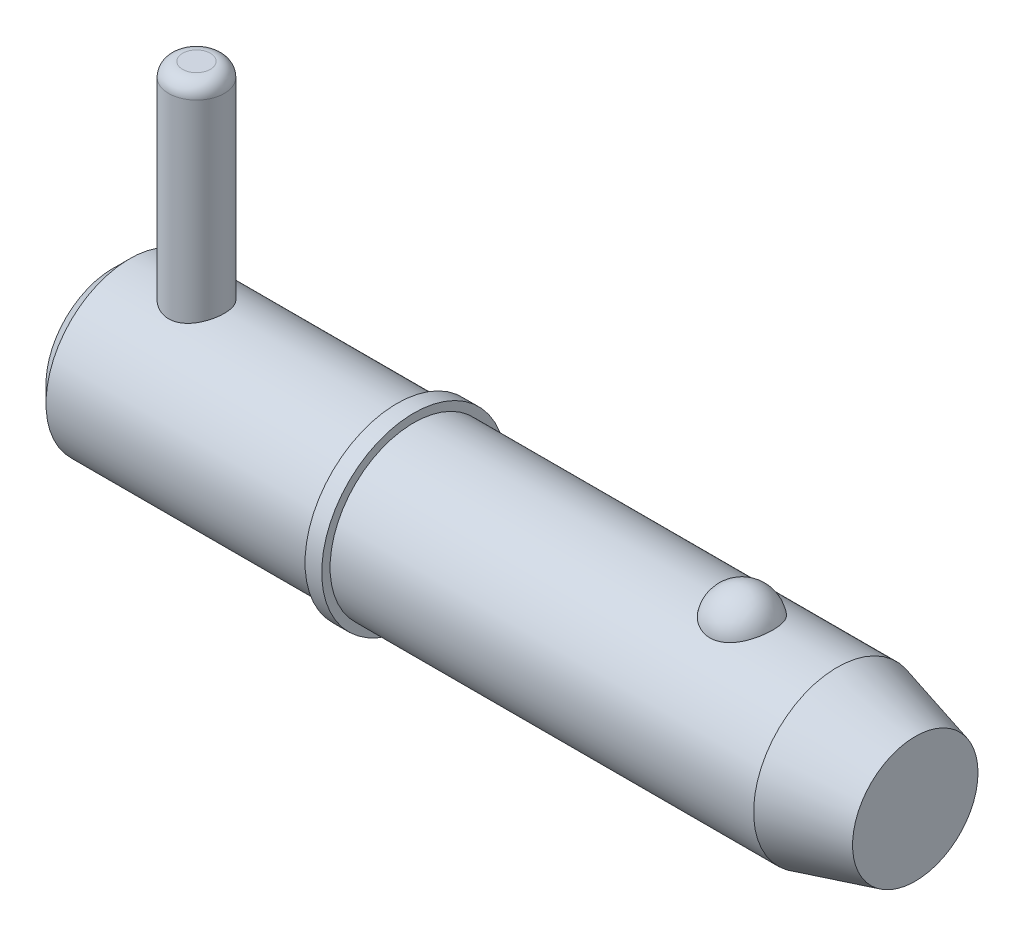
ISO-10303-21;
HEADER;
FILE_DESCRIPTION(('STEP AP214'),'2;1');
FILE_NAME('part.step','',(''),(''),'','','');
FILE_SCHEMA(('AUTOMOTIVE_DESIGN { 1 0 10303 214 1 1 1 1 }'));
ENDSEC;
DATA;
#1=APPLICATION_CONTEXT('core data for automotive mechanical design processes');
#2=APPLICATION_PROTOCOL_DEFINITION('international standard','automotive_design',2000,#1);
#3=PRODUCT_CONTEXT('',#1,'mechanical');
#4=PRODUCT('Part','Part','',(#3));
#5=PRODUCT_RELATED_PRODUCT_CATEGORY('part','',(#4));
#6=PRODUCT_DEFINITION_FORMATION('','',#4);
#7=PRODUCT_DEFINITION_CONTEXT('part definition',#1,'design');
#8=PRODUCT_DEFINITION('design','',#6,#7);
#9=PRODUCT_DEFINITION_SHAPE('','',#8);
#10=(LENGTH_UNIT() NAMED_UNIT(*) SI_UNIT(.MILLI.,.METRE.));
#11=(NAMED_UNIT(*) PLANE_ANGLE_UNIT() SI_UNIT($,.RADIAN.));
#12=(NAMED_UNIT(*) SI_UNIT($,.STERADIAN.) SOLID_ANGLE_UNIT());
#13=UNCERTAINTY_MEASURE_WITH_UNIT(LENGTH_MEASURE(1.E-05),#10,'distance_accuracy_value','');
#14=(GEOMETRIC_REPRESENTATION_CONTEXT(3) GLOBAL_UNCERTAINTY_ASSIGNED_CONTEXT((#13)) GLOBAL_UNIT_ASSIGNED_CONTEXT((#10,
#11,#12)) REPRESENTATION_CONTEXT('',''));
#15=CARTESIAN_POINT('',(0.,0.,0.));
#16=DIRECTION('',(0.,0.,1.));
#17=DIRECTION('',(1.,0.,0.));
#18=AXIS2_PLACEMENT_3D('',#15,#16,#17);
#19=CARTESIAN_POINT('',(7.14,24.605,0.));
#20=DIRECTION('',(0.,-1.,0.));
#21=DIRECTION('',(0.,0.,-1.));
#22=AXIS2_PLACEMENT_3D('',#19,#20,#21);
#23=CYLINDRICAL_SURFACE('',#22,2.38);
#24=CARTESIAN_POINT('',(7.14,-5.955,0.));
#25=DIRECTION('',(0.,1.,0.));
#26=DIRECTION('',(0.,0.,1.));
#27=AXIS2_PLACEMENT_3D('',#24,#25,#26);
#28=CIRCLE('',#27,2.38);
#29=CARTESIAN_POINT('',(7.14,-5.955,2.38));
#30=VERTEX_POINT('',#29);
#31=EDGE_CURVE('P0_E25',#30,#30,#28,.T.);
#32=ORIENTED_EDGE('',*,*,#31,.T.);
#33=EDGE_LOOP('',(#32));
#34=FACE_BOUND('',#33,.T.);
#35=CARTESIAN_POINT('',(7.14,23.415,0.));
#36=DIRECTION('',(0.,1.,0.));
#37=DIRECTION('',(0.,0.,1.));
#38=AXIS2_PLACEMENT_3D('',#35,#36,#37);
#39=CIRCLE('',#38,2.38);
#40=CARTESIAN_POINT('',(7.14,23.415,2.38));
#41=VERTEX_POINT('',#40);
#42=EDGE_CURVE('P0_E29',#41,#41,#39,.F.);
#43=ORIENTED_EDGE('',*,*,#42,.T.);
#44=EDGE_LOOP('',(#43));
#45=FACE_BOUND('',#44,.T.);
#46=ADVANCED_FACE('P0_F14',(#34,#45),#23,.T.);
#47=CARTESIAN_POINT('',(7.14,24.605,0.));
#48=DIRECTION('',(0.,1.,0.));
#49=DIRECTION('',(0.,0.,1.));
#50=AXIS2_PLACEMENT_3D('',#47,#48,#49);
#51=PLANE('',#50);
#52=CARTESIAN_POINT('',(7.14,24.605,0.));
#53=DIRECTION('',(0.,1.,0.));
#54=DIRECTION('',(0.,0.,1.));
#55=AXIS2_PLACEMENT_3D('',#52,#53,#54);
#56=CIRCLE('',#55,1.19);
#57=CARTESIAN_POINT('',(7.14,24.605,1.19));
#58=VERTEX_POINT('',#57);
#59=EDGE_CURVE('P0_E10',#58,#58,#56,.T.);
#60=ORIENTED_EDGE('',*,*,#59,.T.);
#61=EDGE_LOOP('',(#60));
#62=FACE_BOUND('',#61,.T.);
#63=ADVANCED_FACE('P0_F46',(#62),#51,.T.);
#64=CARTESIAN_POINT('',(7.14,-7.145,0.));
#65=DIRECTION('',(0.,1.,0.));
#66=DIRECTION('',(0.,0.,1.));
#67=AXIS2_PLACEMENT_3D('',#64,#65,#66);
#68=PLANE('',#67);
#69=CARTESIAN_POINT('',(7.14,-7.145,0.));
#70=DIRECTION('',(0.,1.,0.));
#71=DIRECTION('',(0.,0.,1.));
#72=AXIS2_PLACEMENT_3D('',#69,#70,#71);
#73=CIRCLE('',#72,1.19);
#74=CARTESIAN_POINT('',(7.14,-7.145,1.19));
#75=VERTEX_POINT('',#74);
#76=EDGE_CURVE('P0_E21',#75,#75,#73,.F.);
#77=ORIENTED_EDGE('',*,*,#76,.T.);
#78=EDGE_LOOP('',(#77));
#79=FACE_BOUND('',#78,.T.);
#80=ADVANCED_FACE('P0_F43',(#79),#68,.F.);
#81=CARTESIAN_POINT('',(7.14,-5.955,0.));
#82=DIRECTION('',(0.,1.,0.));
#83=DIRECTION('',(0.,0.,1.));
#84=AXIS2_PLACEMENT_3D('',#81,#82,#83);
#85=DEGENERATE_TOROIDAL_SURFACE('',#84,1.19,1.19,.T.);
#86=ORIENTED_EDGE('',*,*,#76,.F.);
#87=EDGE_LOOP('',(#86));
#88=FACE_BOUND('',#87,.T.);
#89=ORIENTED_EDGE('',*,*,#31,.F.);
#90=EDGE_LOOP('',(#89));
#91=FACE_BOUND('',#90,.T.);
#92=ADVANCED_FACE('P0_F38',(#88,#91),#85,.T.);
#93=CARTESIAN_POINT('',(7.14,23.415,0.));
#94=DIRECTION('',(0.,1.,0.));
#95=DIRECTION('',(0.,0.,1.));
#96=AXIS2_PLACEMENT_3D('',#93,#94,#95);
#97=DEGENERATE_TOROIDAL_SURFACE('',#96,1.19,1.19,.T.);
#98=ORIENTED_EDGE('',*,*,#42,.F.);
#99=EDGE_LOOP('',(#98));
#100=FACE_BOUND('',#99,.T.);
#101=ORIENTED_EDGE('',*,*,#59,.F.);
#102=EDGE_LOOP('',(#101));
#103=FACE_BOUND('',#102,.T.);
#104=ADVANCED_FACE('P0_F16',(#100,#103),#97,.T.);
#105=CLOSED_SHELL('',(#46,#63,#80,#92,#104));
#106=MANIFOLD_SOLID_BREP('P0_B1',#105);
#107=CARTESIAN_POINT('',(0.,0.,0.));
#108=DIRECTION('',(1.,0.,0.));
#109=DIRECTION('',(0.,0.,-1.));
#110=AXIS2_PLACEMENT_3D('',#107,#108,#109);
#111=CYLINDRICAL_SURFACE('',#110,7.145);
#112=CARTESIAN_POINT('',(61.8836242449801,0.,0.));
#113=DIRECTION('',(1.,0.,0.));
#114=DIRECTION('',(0.,0.,-1.));
#115=AXIS2_PLACEMENT_3D('',#112,#113,#114);
#116=CIRCLE('',#115,7.145);
#117=CARTESIAN_POINT('',(61.8836242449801,0.,-7.145));
#118=VERTEX_POINT('',#117);
#119=EDGE_CURVE('P1_E81',#118,#118,#116,.T.);
#120=ORIENTED_EDGE('',*,*,#119,.F.);
#121=EDGE_LOOP('',(#120));
#122=FACE_BOUND('',#121,.T.);
#123=CARTESIAN_POINT('',(25.7,0.,0.));
#124=DIRECTION('',(1.,0.,0.));
#125=DIRECTION('',(0.,0.,-1.));
#126=AXIS2_PLACEMENT_3D('',#123,#124,#125);
#127=CIRCLE('',#126,7.145);
#128=CARTESIAN_POINT('',(25.7,0.,-7.145));
#129=VERTEX_POINT('',#128);
#130=EDGE_CURVE('P1_E85',#129,#129,#127,.T.);
#131=ORIENTED_EDGE('',*,*,#130,.T.);
#132=EDGE_LOOP('',(#131));
#133=FACE_BOUND('',#132,.T.);
#134=CARTESIAN_POINT('',(53.7395037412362,6.60328629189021,2.72903557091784));
#135=CARTESIAN_POINT('',(53.5983158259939,6.60329644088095,2.7290249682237));
#136=CARTESIAN_POINT('',(53.4568832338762,6.60799490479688,2.71772840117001));
#137=CARTESIAN_POINT('',(53.1779557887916,6.62628236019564,2.6728193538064));
#138=CARTESIAN_POINT('',(53.0404726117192,6.63989534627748,2.63914664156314));
#139=CARTESIAN_POINT('',(52.7738894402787,6.67440775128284,2.55059642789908));
#140=CARTESIAN_POINT('',(52.6447683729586,6.69528793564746,2.49577486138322));
#141=CARTESIAN_POINT('',(52.3978694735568,6.74205585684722,2.36651799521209));
#142=CARTESIAN_POINT('',(52.2800865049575,6.76794130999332,2.29209163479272));
#143=CARTESIAN_POINT('',(52.0551671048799,6.82286177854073,2.12312937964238));
#144=CARTESIAN_POINT('',(51.9484405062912,6.85196655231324,2.02807107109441));
#145=CARTESIAN_POINT('',(51.7519181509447,6.90970232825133,1.82167822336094));
#146=CARTESIAN_POINT('',(51.6621276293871,6.93833318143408,1.71033867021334));
#147=CARTESIAN_POINT('',(51.4976670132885,6.9935167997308,1.46891951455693));
#148=CARTESIAN_POINT('',(51.423844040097,7.01992110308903,1.33822781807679));
#149=CARTESIAN_POINT('',(51.2980884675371,7.06643385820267,1.0656656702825));
#150=CARTESIAN_POINT('',(51.2461573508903,7.08654188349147,0.923794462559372));
#151=CARTESIAN_POINT('',(51.1647323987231,7.11862399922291,0.630993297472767));
#152=CARTESIAN_POINT('',(51.1355167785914,7.13049704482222,0.479974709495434));
#153=CARTESIAN_POINT('',(51.1011742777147,7.14449484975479,0.174782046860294));
#154=CARTESIAN_POINT('',(51.0960466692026,7.14661990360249,0.0206080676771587));
#155=CARTESIAN_POINT('',(51.109938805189,7.14092465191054,-0.285506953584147));
#156=CARTESIAN_POINT('',(51.1288101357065,7.1331654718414,-0.437455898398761));
#157=CARTESIAN_POINT('',(51.1900622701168,7.10859076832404,-0.735778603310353));
#158=CARTESIAN_POINT('',(51.2324435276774,7.0917750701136,-0.882152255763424));
#159=CARTESIAN_POINT('',(51.3399346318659,7.05076716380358,-1.165431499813));
#160=CARTESIAN_POINT('',(51.4050759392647,7.02656475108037,-1.30232366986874));
#161=CARTESIAN_POINT('',(51.5567597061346,6.97329145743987,-1.56265907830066));
#162=CARTESIAN_POINT('',(51.643303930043,6.94422017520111,-1.68610120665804));
#163=CARTESIAN_POINT('',(51.8364654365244,6.88415108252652,-1.91671004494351));
#164=CARTESIAN_POINT('',(51.9431807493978,6.85314438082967,-2.02379244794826));
#165=CARTESIAN_POINT('',(52.1739740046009,6.79282069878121,-2.21787433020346));
#166=CARTESIAN_POINT('',(52.2980505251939,6.76350358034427,-2.30487545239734));
#167=CARTESIAN_POINT('',(52.5576784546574,6.71060580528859,-2.45458647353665));
#168=CARTESIAN_POINT('',(52.6929387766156,6.68691885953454,-2.51776240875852));
#169=CARTESIAN_POINT('',(52.9732778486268,6.64741247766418,-2.62030218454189));
#170=CARTESIAN_POINT('',(53.1183528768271,6.63159007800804,-2.65967499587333));
#171=CARTESIAN_POINT('',(53.4063475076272,6.61038594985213,-2.71193301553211));
#172=CARTESIAN_POINT('',(53.5490080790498,6.60451880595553,-2.72605165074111));
#173=CARTESIAN_POINT('',(53.8348004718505,6.60240611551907,-2.73116688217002));
#174=CARTESIAN_POINT('',(53.9779321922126,6.60615862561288,-2.72216814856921));
#175=CARTESIAN_POINT('',(54.2558486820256,6.6225609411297,-2.68200435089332));
#176=CARTESIAN_POINT('',(54.3907542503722,6.63492533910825,-2.65154998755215));
#177=CARTESIAN_POINT('',(54.65332009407,6.66687445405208,-2.57015684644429));
#178=CARTESIAN_POINT('',(54.7809797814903,6.68645975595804,-2.51921640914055));
#179=CARTESIAN_POINT('',(55.0285777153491,6.73127274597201,-2.39693610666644));
#180=CARTESIAN_POINT('',(55.148287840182,6.7566138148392,-2.32517694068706));
#181=CARTESIAN_POINT('',(55.3741592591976,6.8100600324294,-2.16363812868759));
#182=CARTESIAN_POINT('',(55.480317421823,6.83816581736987,-2.07385432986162));
#183=CARTESIAN_POINT('',(55.6818620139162,6.89580469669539,-1.87357235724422));
#184=CARTESIAN_POINT('',(55.776440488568,6.92533863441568,-1.76226074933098));
#185=CARTESIAN_POINT('',(55.9463329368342,6.98139526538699,-1.52511696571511));
#186=CARTESIAN_POINT('',(56.0216434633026,7.0079174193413,-1.39928219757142));
#187=CARTESIAN_POINT('',(56.153595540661,7.05607625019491,-1.1321597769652));
#188=CARTESIAN_POINT('',(56.2095688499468,7.07753119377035,-0.990508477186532));
#189=CARTESIAN_POINT('',(56.2982965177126,7.11222355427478,-0.699154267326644));
#190=CARTESIAN_POINT('',(56.3310506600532,7.12546089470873,-0.549451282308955));
#191=CARTESIAN_POINT('',(56.3726899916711,7.14237584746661,-0.246120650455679));
#192=CARTESIAN_POINT('',(56.381558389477,7.14604673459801,-0.0924903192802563));
#193=CARTESIAN_POINT('',(56.3751940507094,7.14343510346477,0.214181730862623));
#194=CARTESIAN_POINT('',(56.3599618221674,7.13715279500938,0.367223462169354));
#195=CARTESIAN_POINT('',(56.3058451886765,7.1153294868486,0.667595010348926));
#196=CARTESIAN_POINT('',(56.2670776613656,7.09983424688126,0.814949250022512));
#197=CARTESIAN_POINT('',(56.1667700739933,7.06119140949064,1.10063221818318));
#198=CARTESIAN_POINT('',(56.1052284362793,7.03804328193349,1.238960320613));
#199=CARTESIAN_POINT('',(55.9602071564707,6.98632429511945,1.50352300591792));
#200=CARTESIAN_POINT('',(55.8766067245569,6.95772382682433,1.62968561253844));
#201=CARTESIAN_POINT('',(55.6893804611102,6.89823072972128,1.86554304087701));
#202=CARTESIAN_POINT('',(55.5857557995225,6.86733823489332,1.97523882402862));
#203=CARTESIAN_POINT('',(55.3610769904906,6.80676456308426,2.17482293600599));
#204=CARTESIAN_POINT('',(55.2400673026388,6.7770805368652,2.26476035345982));
#205=CARTESIAN_POINT('',(54.9833408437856,6.7223050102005,2.42252989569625));
#206=CARTESIAN_POINT('',(54.84761851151,6.69721525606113,2.49035362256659));
#207=CARTESIAN_POINT('',(54.5704022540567,6.65552591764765,2.59967646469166));
#208=CARTESIAN_POINT('',(54.4292810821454,6.63865794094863,2.64202017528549));
#209=CARTESIAN_POINT('',(54.1414448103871,6.61425039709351,2.7025584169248));
#210=CARTESIAN_POINT('',(53.9947480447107,6.606682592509,2.72082606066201));
#211=CARTESIAN_POINT('',(53.8116799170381,6.60358754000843,2.72830331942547));
#212=CARTESIAN_POINT('',(53.7755998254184,6.60328369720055,2.72903828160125));
#213=CARTESIAN_POINT('',(53.7395037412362,6.60328629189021,2.72903557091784));
#214=B_SPLINE_CURVE_WITH_KNOTS('',3,(#134,#135,#136,#137,#138,#139,#140,#141,#142,#143,#144,
#145,#146,#147,#148,#149,#150,#151,#152,#153,#154,#155,#156,#157,#158,#159,#160,#161,#162,#163,
#164,#165,#166,#167,#168,#169,#170,#171,#172,#173,#174,#175,#176,#177,#178,#179,#180,#181,#182,
#183,#184,#185,#186,#187,#188,#189,#190,#191,#192,#193,#194,#195,#196,#197,#198,#199,#200,#201,
#202,#203,#204,#205,#206,#207,#208,#209,#210,#211,#212,#213),.UNSPECIFIED.,.T.,.F.,(4,2,2,2,2,2,
2,2,2,2,2,2,2,2,2,2,2,2,2,2,2,2,2,2,2,2,2,2,2,2,2,2,2,2,2,2,2,2,2,4),(0.,0.423468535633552,
0.848081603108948,1.27157926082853,1.69488414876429,2.13051395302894,2.56627819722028,
3.02136706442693,3.47648674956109,3.93709649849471,4.39769233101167,4.85545355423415,
5.31322361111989,5.77162895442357,6.23007210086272,6.69080337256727,7.15149693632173,
7.60264329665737,8.05361952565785,8.48189729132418,8.91008854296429,9.32472524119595,
9.73939553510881,10.1630783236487,10.5868588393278,11.0319070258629,11.4770347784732,
11.9362874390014,12.3955443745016,12.8551240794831,13.3146940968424,13.7720003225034,
14.2293382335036,14.6892343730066,15.1491036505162,15.6078171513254,16.0667046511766,
16.5093965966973,16.9507410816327,17.0590049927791),.UNSPECIFIED.);
#215=CARTESIAN_POINT('',(53.7395037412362,6.60328629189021,2.72903557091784));
#216=VERTEX_POINT('',#215);
#217=EDGE_CURVE('P1_E35',#216,#216,#214,.T.);
#218=ORIENTED_EDGE('',*,*,#217,.T.);
#219=EDGE_LOOP('',(#218));
#220=FACE_BOUND('',#219,.T.);
#221=ADVANCED_FACE('P1_F13',(#122,#133,#220),#111,.T.);
#222=CARTESIAN_POINT('',(0.,0.,0.));
#223=DIRECTION('',(-1.,0.,0.));
#224=DIRECTION('',(0.,0.,1.));
#225=AXIS2_PLACEMENT_3D('',#222,#223,#224);
#226=PLANE('',#225);
#227=CARTESIAN_POINT('',(0.,0.,0.));
#228=DIRECTION('',(1.,0.,0.));
#229=DIRECTION('',(0.,0.,-1.));
#230=AXIS2_PLACEMENT_3D('',#227,#228,#229);
#231=CIRCLE('',#230,5.716);
#232=CARTESIAN_POINT('',(0.,0.,-5.716));
#233=VERTEX_POINT('',#232);
#234=EDGE_CURVE('P1_E9',#233,#233,#231,.T.);
#235=ORIENTED_EDGE('',*,*,#234,.F.);
#236=EDGE_LOOP('',(#235));
#237=FACE_BOUND('',#236,.T.);
#238=ADVANCED_FACE('P1_F15',(#237),#226,.T.);
#239=CARTESIAN_POINT('',(1.42899999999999,0.,0.));
#240=DIRECTION('',(1.,0.,0.));
#241=DIRECTION('',(0.,0.,-1.));
#242=AXIS2_PLACEMENT_3D('',#239,#240,#241);
#243=CONICAL_SURFACE('',#242,7.145,0.78539816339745);
#244=ORIENTED_EDGE('',*,*,#234,.T.);
#245=EDGE_LOOP('',(#244));
#246=FACE_BOUND('',#245,.T.);
#247=CARTESIAN_POINT('',(1.42899999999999,0.,0.));
#248=DIRECTION('',(1.,0.,0.));
#249=DIRECTION('',(0.,0.,-1.));
#250=AXIS2_PLACEMENT_3D('',#247,#248,#249);
#251=CIRCLE('',#250,7.145);
#252=CARTESIAN_POINT('',(1.42899999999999,0.,-7.145));
#253=VERTEX_POINT('',#252);
#254=EDGE_CURVE('P1_E26',#253,#253,#251,.T.);
#255=ORIENTED_EDGE('',*,*,#254,.F.);
#256=EDGE_LOOP('',(#255));
#257=FACE_BOUND('',#256,.T.);
#258=ADVANCED_FACE('P1_F77',(#246,#257),#243,.T.);
#259=CARTESIAN_POINT('',(0.,0.,0.));
#260=DIRECTION('',(1.,0.,0.));
#261=DIRECTION('',(0.,0.,-1.));
#262=AXIS2_PLACEMENT_3D('',#259,#260,#261);
#263=CYLINDRICAL_SURFACE('',#262,7.145);
#264=CARTESIAN_POINT('',(7.14,-6.73695962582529,2.38));
#265=CARTESIAN_POINT('',(7.01035997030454,-6.73695921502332,2.38000059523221));
#266=CARTESIAN_POINT('',(6.88072348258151,-6.74074253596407,2.36937183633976));
#267=CARTESIAN_POINT('',(6.62529075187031,-6.75538853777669,2.32728080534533));
#268=CARTESIAN_POINT('',(6.49949514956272,-6.76625239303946,2.29581507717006));
#269=CARTESIAN_POINT('',(6.2554858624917,-6.79369535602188,2.21327763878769));
#270=CARTESIAN_POINT('',(6.13725786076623,-6.81026326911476,2.16224430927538));
#271=CARTESIAN_POINT('',(5.91100349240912,-6.84723128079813,2.04215132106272));
#272=CARTESIAN_POINT('',(5.80297937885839,-6.86763222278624,1.97308769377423));
#273=CARTESIAN_POINT('',(5.59597854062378,-6.91086152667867,1.81600414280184));
#274=CARTESIAN_POINT('',(5.49745861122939,-6.93375032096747,1.72739874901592));
#275=CARTESIAN_POINT('',(5.31636508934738,-6.97886546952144,1.53499636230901));
#276=CARTESIAN_POINT('',(5.23379405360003,-7.00109171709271,1.43119693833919));
#277=CARTESIAN_POINT('',(5.08487013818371,-7.04307708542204,1.20801318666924));
#278=CARTESIAN_POINT('',(5.01899578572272,-7.06275685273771,1.08829330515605));
#279=CARTESIAN_POINT('',(4.90850130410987,-7.09671988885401,0.838703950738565));
#280=CARTESIAN_POINT('',(4.86387545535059,-7.11100460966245,0.70883722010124));
#281=CARTESIAN_POINT('',(4.79869354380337,-7.13213998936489,0.44742990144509));
#282=CARTESIAN_POINT('',(4.77735497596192,-7.13923172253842,0.316104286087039));
#283=CARTESIAN_POINT('',(4.75686536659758,-7.14603777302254,0.0515578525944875));
#284=CARTESIAN_POINT('',(4.75770861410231,-7.14575398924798,-0.0816624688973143));
#285=CARTESIAN_POINT('',(4.78106216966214,-7.13800438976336,-0.340678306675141));
#286=CARTESIAN_POINT('',(4.80272255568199,-7.13082030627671,-0.466560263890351));
#287=CARTESIAN_POINT('',(4.86569013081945,-7.11043095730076,-0.712788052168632));
#288=CARTESIAN_POINT('',(4.90699865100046,-7.09722528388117,-0.833133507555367));
#289=CARTESIAN_POINT('',(5.00858673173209,-7.06591754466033,-1.06673173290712));
#290=CARTESIAN_POINT('',(5.06910834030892,-7.0477534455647,-1.17987058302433));
#291=CARTESIAN_POINT('',(5.20720514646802,-7.00841977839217,-1.39463797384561));
#292=CARTESIAN_POINT('',(5.28478508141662,-6.987249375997,-1.49626330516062));
#293=CARTESIAN_POINT('',(5.4590800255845,-6.94296010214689,-1.69017445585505));
#294=CARTESIAN_POINT('',(5.55652324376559,-6.91979641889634,-1.78179645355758));
#295=CARTESIAN_POINT('',(5.76558873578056,-6.87497076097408,-1.94761348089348));
#296=CARTESIAN_POINT('',(5.87721318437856,-6.85330901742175,-2.02180583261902));
#297=CARTESIAN_POINT('',(6.11357367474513,-6.81369485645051,-2.15157488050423));
#298=CARTESIAN_POINT('',(6.23847358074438,-6.79579956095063,-2.20687188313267));
#299=CARTESIAN_POINT('',(6.49655785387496,-6.76640630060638,-2.29542443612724));
#300=CARTESIAN_POINT('',(6.62973872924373,-6.75490565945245,-2.32868920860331));
#301=CARTESIAN_POINT('',(6.89417536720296,-6.74020933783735,-2.37088225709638));
#302=CARTESIAN_POINT('',(7.02524746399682,-6.73666278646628,-2.38083959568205));
#303=CARTESIAN_POINT('',(7.28721035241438,-6.73729555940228,-2.37904974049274));
#304=CARTESIAN_POINT('',(7.41810117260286,-6.7414734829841,-2.36730648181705));
#305=CARTESIAN_POINT('',(7.67130717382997,-6.75673471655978,-2.32337336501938));
#306=CARTESIAN_POINT('',(7.79376251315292,-6.76757635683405,-2.29189834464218));
#307=CARTESIAN_POINT('',(8.03162917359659,-6.79467771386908,-2.21025275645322));
#308=CARTESIAN_POINT('',(8.14703924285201,-6.8109383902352,-2.16007887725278));
#309=CARTESIAN_POINT('',(8.37159169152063,-6.84768362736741,-2.04065289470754));
#310=CARTESIAN_POINT('',(8.48041962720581,-6.86828569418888,-1.97084668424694));
#311=CARTESIAN_POINT('',(8.68518919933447,-6.91116416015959,-1.8147657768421));
#312=CARTESIAN_POINT('',(8.78112702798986,-6.93344105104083,-1.72848623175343));
#313=CARTESIAN_POINT('',(8.96215574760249,-6.97845348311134,-1.53698616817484));
#314=CARTESIAN_POINT('',(9.04650427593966,-7.00115965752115,-1.43105491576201));
#315=CARTESIAN_POINT('',(9.19627592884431,-7.04341676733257,-1.20598377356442));
#316=CARTESIAN_POINT('',(9.26169972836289,-7.06296781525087,-1.08684435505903));
#317=CARTESIAN_POINT('',(9.37116617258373,-7.0966205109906,-0.83933303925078));
#318=CARTESIAN_POINT('',(9.41534821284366,-7.11075755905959,-0.711027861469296));
#319=CARTESIAN_POINT('',(9.48132660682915,-7.13214194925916,-0.448245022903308));
#320=CARTESIAN_POINT('',(9.50313102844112,-7.13939177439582,-0.313769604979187));
#321=CARTESIAN_POINT('',(9.5230098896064,-7.14599771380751,-0.049254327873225));
#322=CARTESIAN_POINT('',(9.52215013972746,-7.14570837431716,0.0806974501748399));
#323=CARTESIAN_POINT('',(9.49935359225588,-7.13814116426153,0.338518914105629));
#324=CARTESIAN_POINT('',(9.47741850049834,-7.13086385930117,0.466388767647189));
#325=CARTESIAN_POINT('',(9.4138005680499,-7.11026814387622,0.714400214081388));
#326=CARTESIAN_POINT('',(9.37243609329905,-7.09704726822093,0.834632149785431));
#327=CARTESIAN_POINT('',(9.27142829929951,-7.06592602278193,1.06649582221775));
#328=CARTESIAN_POINT('',(9.2117816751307,-7.04802480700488,1.1781259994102));
#329=CARTESIAN_POINT('',(9.07336776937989,-7.00856499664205,1.39411030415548));
#330=CARTESIAN_POINT('',(8.99397590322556,-6.98689577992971,1.49804368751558));
#331=CARTESIAN_POINT('',(8.81938810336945,-6.9426110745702,1.69146078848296));
#332=CARTESIAN_POINT('',(8.72418713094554,-6.91999528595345,1.78093988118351));
#333=CARTESIAN_POINT('',(8.51623540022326,-6.87531507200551,1.94646188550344));
#334=CARTESIAN_POINT('',(8.4029442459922,-6.85330672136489,2.02184316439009));
#335=CARTESIAN_POINT('',(8.16461714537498,-6.81342065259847,2.1524427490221));
#336=CARTESIAN_POINT('',(8.03958429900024,-6.7955418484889,2.20766635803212));
#337=CARTESIAN_POINT('',(7.78712566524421,-6.76686117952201,2.29403636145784));
#338=CARTESIAN_POINT('',(7.66006989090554,-6.75577342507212,2.32616709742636));
#339=CARTESIAN_POINT('',(7.40200728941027,-6.74082409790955,2.36914495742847));
#340=CARTESIAN_POINT('',(7.27100183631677,-6.73696004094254,2.37999939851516));
#341=CARTESIAN_POINT('',(7.14,-6.73695962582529,2.38));
#342=B_SPLINE_CURVE_WITH_KNOTS('',3,(#264,#265,#266,#267,#268,#269,#270,#271,#272,#273,#274,
#275,#276,#277,#278,#279,#280,#281,#282,#283,#284,#285,#286,#287,#288,#289,#290,#291,#292,#293,
#294,#295,#296,#297,#298,#299,#300,#301,#302,#303,#304,#305,#306,#307,#308,#309,#310,#311,#312,
#313,#314,#315,#316,#317,#318,#319,#320,#321,#322,#323,#324,#325,#326,#327,#328,#329,#330,#331,
#332,#333,#334,#335,#336,#337,#338,#339,#340,#341),.UNSPECIFIED.,.T.,.F.,(4,2,2,2,2,2,2,2,2,2,2,
2,2,2,2,2,2,2,2,2,2,2,2,2,2,2,2,2,2,2,2,2,2,2,2,2,2,2,4),(0.,0.388434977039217,
0.776934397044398,1.16467566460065,1.55250234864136,1.9540847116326,2.35573139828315,
2.76784120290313,3.17984001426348,3.57752248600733,3.97510257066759,4.35711073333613,
4.7391447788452,5.12619663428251,5.51335611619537,5.91871976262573,6.3241456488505,
6.73533623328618,7.14635459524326,7.53885245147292,7.93127914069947,8.31025106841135,
8.68929014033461,9.08033871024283,9.47150254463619,9.88145528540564,10.2913934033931,
10.6986033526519,11.1056664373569,11.4936225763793,11.8815473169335,12.2633262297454,
12.645174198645,13.0411187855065,13.437189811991,13.8487371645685,14.2601761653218,
14.6528265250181,15.0453418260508),.UNSPECIFIED.);
#343=CARTESIAN_POINT('',(7.14,-6.73695962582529,2.38));
#344=VERTEX_POINT('',#343);
#345=EDGE_CURVE('P1_E17',#344,#344,#342,.T.);
#346=ORIENTED_EDGE('',*,*,#345,.F.);
#347=EDGE_LOOP('',(#346));
#348=FACE_BOUND('',#347,.T.);
#349=CARTESIAN_POINT('',(7.14,6.73695962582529,2.38));
#350=CARTESIAN_POINT('',(7.26964002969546,6.73695921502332,2.38000059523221));
#351=CARTESIAN_POINT('',(7.39927651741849,6.74074253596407,2.36937183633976));
#352=CARTESIAN_POINT('',(7.65470924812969,6.75538853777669,2.32728080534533));
#353=CARTESIAN_POINT('',(7.78050485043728,6.76625239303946,2.29581507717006));
#354=CARTESIAN_POINT('',(8.02451413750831,6.79369535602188,2.21327763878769));
#355=CARTESIAN_POINT('',(8.14274213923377,6.81026326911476,2.16224430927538));
#356=CARTESIAN_POINT('',(8.36899650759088,6.84723128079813,2.04215132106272));
#357=CARTESIAN_POINT('',(8.47702062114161,6.86763222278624,1.97308769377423));
#358=CARTESIAN_POINT('',(8.68402145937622,6.91086152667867,1.81600414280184));
#359=CARTESIAN_POINT('',(8.78254138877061,6.93375032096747,1.72739874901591));
#360=CARTESIAN_POINT('',(8.96363491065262,6.97886546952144,1.53499636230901));
#361=CARTESIAN_POINT('',(9.04620594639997,7.00109171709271,1.43119693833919));
#362=CARTESIAN_POINT('',(9.19512986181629,7.04307708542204,1.20801318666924));
#363=CARTESIAN_POINT('',(9.26100421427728,7.06275685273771,1.08829330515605));
#364=CARTESIAN_POINT('',(9.37149869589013,7.09671988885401,0.838703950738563));
#365=CARTESIAN_POINT('',(9.41612454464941,7.11100460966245,0.708837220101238));
#366=CARTESIAN_POINT('',(9.48130645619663,7.13213998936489,0.447429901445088));
#367=CARTESIAN_POINT('',(9.50264502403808,7.13923172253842,0.316104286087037));
#368=CARTESIAN_POINT('',(9.52313463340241,7.14603777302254,0.0515578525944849));
#369=CARTESIAN_POINT('',(9.52229138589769,7.14575398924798,-0.0816624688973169));
#370=CARTESIAN_POINT('',(9.49893783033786,7.13800438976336,-0.340678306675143));
#371=CARTESIAN_POINT('',(9.47727744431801,7.13082030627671,-0.466560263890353));
#372=CARTESIAN_POINT('',(9.41430986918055,7.11043095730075,-0.712788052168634));
#373=CARTESIAN_POINT('',(9.37300134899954,7.09722528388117,-0.833133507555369));
#374=CARTESIAN_POINT('',(9.27141326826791,7.06591754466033,-1.06673173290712));
#375=CARTESIAN_POINT('',(9.21089165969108,7.0477534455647,-1.17987058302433));
#376=CARTESIAN_POINT('',(9.07279485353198,7.00841977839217,-1.39463797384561));
#377=CARTESIAN_POINT('',(8.99521491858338,6.987249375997,-1.49626330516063));
#378=CARTESIAN_POINT('',(8.82091997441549,6.94296010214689,-1.69017445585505));
#379=CARTESIAN_POINT('',(8.72347675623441,6.91979641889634,-1.78179645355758));
#380=CARTESIAN_POINT('',(8.51441126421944,6.87497076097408,-1.94761348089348));
#381=CARTESIAN_POINT('',(8.40278681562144,6.85330901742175,-2.02180583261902));
#382=CARTESIAN_POINT('',(8.16642632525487,6.81369485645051,-2.15157488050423));
#383=CARTESIAN_POINT('',(8.04152641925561,6.79579956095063,-2.20687188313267));
#384=CARTESIAN_POINT('',(7.78344214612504,6.76640630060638,-2.29542443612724));
#385=CARTESIAN_POINT('',(7.65026127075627,6.75490565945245,-2.32868920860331));
#386=CARTESIAN_POINT('',(7.38582463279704,6.74020933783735,-2.37088225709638));
#387=CARTESIAN_POINT('',(7.25475253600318,6.73666278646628,-2.38083959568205));
#388=CARTESIAN_POINT('',(6.99278964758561,6.73729555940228,-2.37904974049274));
#389=CARTESIAN_POINT('',(6.86189882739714,6.7414734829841,-2.36730648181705));
#390=CARTESIAN_POINT('',(6.60869282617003,6.75673471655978,-2.32337336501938));
#391=CARTESIAN_POINT('',(6.48623748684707,6.76757635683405,-2.29189834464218));
#392=CARTESIAN_POINT('',(6.2483708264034,6.79467771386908,-2.21025275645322));
#393=CARTESIAN_POINT('',(6.13296075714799,6.8109383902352,-2.16007887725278));
#394=CARTESIAN_POINT('',(5.90840830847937,6.84768362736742,-2.04065289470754));
#395=CARTESIAN_POINT('',(5.79958037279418,6.86828569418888,-1.97084668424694));
#396=CARTESIAN_POINT('',(5.59481080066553,6.91116416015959,-1.8147657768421));
#397=CARTESIAN_POINT('',(5.49887297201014,6.93344105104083,-1.72848623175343));
#398=CARTESIAN_POINT('',(5.31784425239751,6.97845348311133,-1.53698616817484));
#399=CARTESIAN_POINT('',(5.23349572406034,7.00115965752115,-1.43105491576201));
#400=CARTESIAN_POINT('',(5.08372407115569,7.04341676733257,-1.20598377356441));
#401=CARTESIAN_POINT('',(5.01830027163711,7.06296781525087,-1.08684435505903));
#402=CARTESIAN_POINT('',(4.90883382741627,7.0966205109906,-0.839333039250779));
#403=CARTESIAN_POINT('',(4.86465178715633,7.11075755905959,-0.711027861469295));
#404=CARTESIAN_POINT('',(4.79867339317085,7.13214194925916,-0.448245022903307));
#405=CARTESIAN_POINT('',(4.77686897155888,7.13939177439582,-0.313769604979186));
#406=CARTESIAN_POINT('',(4.7569901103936,7.14599771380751,-0.0492543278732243));
#407=CARTESIAN_POINT('',(4.75784986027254,7.14570837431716,0.0806974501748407));
#408=CARTESIAN_POINT('',(4.78064640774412,7.13814116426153,0.33851891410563));
#409=CARTESIAN_POINT('',(4.80258149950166,7.13086385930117,0.46638876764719));
#410=CARTESIAN_POINT('',(4.8661994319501,7.11026814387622,0.714400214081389));
#411=CARTESIAN_POINT('',(4.90756390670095,7.09704726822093,0.834632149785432));
#412=CARTESIAN_POINT('',(5.00857170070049,7.06592602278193,1.06649582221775));
#413=CARTESIAN_POINT('',(5.0682183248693,7.04802480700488,1.1781259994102));
#414=CARTESIAN_POINT('',(5.20663223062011,7.00856499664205,1.39411030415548));
#415=CARTESIAN_POINT('',(5.28602409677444,6.98689577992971,1.49804368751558));
#416=CARTESIAN_POINT('',(5.46061189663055,6.9426110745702,1.69146078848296));
#417=CARTESIAN_POINT('',(5.55581286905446,6.91999528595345,1.78093988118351));
#418=CARTESIAN_POINT('',(5.76376459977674,6.87531507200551,1.94646188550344));
#419=CARTESIAN_POINT('',(5.8770557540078,6.85330672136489,2.02184316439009));
#420=CARTESIAN_POINT('',(6.11538285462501,6.81342065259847,2.1524427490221));
#421=CARTESIAN_POINT('',(6.24041570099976,6.7955418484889,2.20766635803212));
#422=CARTESIAN_POINT('',(6.4928743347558,6.76686117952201,2.29403636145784));
#423=CARTESIAN_POINT('',(6.61993010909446,6.75577342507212,2.32616709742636));
#424=CARTESIAN_POINT('',(6.87799271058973,6.74082409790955,2.36914495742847));
#425=CARTESIAN_POINT('',(7.00899816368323,6.73696004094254,2.37999939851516));
#426=CARTESIAN_POINT('',(7.14,6.73695962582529,2.38));
#427=B_SPLINE_CURVE_WITH_KNOTS('',3,(#349,#350,#351,#352,#353,#354,#355,#356,#357,#358,#359,
#360,#361,#362,#363,#364,#365,#366,#367,#368,#369,#370,#371,#372,#373,#374,#375,#376,#377,#378,
#379,#380,#381,#382,#383,#384,#385,#386,#387,#388,#389,#390,#391,#392,#393,#394,#395,#396,#397,
#398,#399,#400,#401,#402,#403,#404,#405,#406,#407,#408,#409,#410,#411,#412,#413,#414,#415,#416,
#417,#418,#419,#420,#421,#422,#423,#424,#425,#426),.UNSPECIFIED.,.T.,.F.,(4,2,2,2,2,2,2,2,2,2,2,
2,2,2,2,2,2,2,2,2,2,2,2,2,2,2,2,2,2,2,2,2,2,2,2,2,2,2,4),(0.,0.388434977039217,
0.776934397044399,1.16467566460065,1.55250234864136,1.9540847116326,2.35573139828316,
2.76784120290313,3.17984001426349,3.57752248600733,3.97510257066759,4.35711073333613,
4.73914477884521,5.12619663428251,5.51335611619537,5.91871976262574,6.3241456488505,
6.73533623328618,7.14635459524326,7.53885245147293,7.93127914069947,8.31025106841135,
8.68929014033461,9.08033871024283,9.47150254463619,9.88145528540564,10.2913934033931,
10.6986033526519,11.1056664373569,11.4936225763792,11.8815473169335,12.2633262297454,
12.645174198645,13.0411187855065,13.437189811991,13.8487371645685,14.2601761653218,
14.6528265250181,15.0453418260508),.UNSPECIFIED.);
#428=CARTESIAN_POINT('',(7.14,6.73695962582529,2.38));
#429=VERTEX_POINT('',#428);
#430=EDGE_CURVE('P1_E43',#429,#429,#427,.T.);
#431=ORIENTED_EDGE('',*,*,#430,.F.);
#432=EDGE_LOOP('',(#431));
#433=FACE_BOUND('',#432,.T.);
#434=ORIENTED_EDGE('',*,*,#254,.T.);
#435=EDGE_LOOP('',(#434));
#436=FACE_BOUND('',#435,.T.);
#437=CARTESIAN_POINT('',(24.271,0.,0.));
#438=DIRECTION('',(1.,0.,0.));
#439=DIRECTION('',(0.,0.,-1.));
#440=AXIS2_PLACEMENT_3D('',#437,#438,#439);
#441=CIRCLE('',#440,7.145);
#442=CARTESIAN_POINT('',(24.271,0.,-7.145));
#443=VERTEX_POINT('',#442);
#444=EDGE_CURVE('P1_E31',#443,#443,#441,.T.);
#445=ORIENTED_EDGE('',*,*,#444,.F.);
#446=EDGE_LOOP('',(#445));
#447=FACE_BOUND('',#446,.T.);
#448=ADVANCED_FACE('P1_F103',(#348,#433,#436,#447),#263,.T.);
#449=CARTESIAN_POINT('',(24.271,7.145,0.));
#450=DIRECTION('',(-1.,0.,0.));
#451=DIRECTION('',(0.,0.,1.));
#452=AXIS2_PLACEMENT_3D('',#449,#450,#451);
#453=PLANE('',#452);
#454=ORIENTED_EDGE('',*,*,#444,.T.);
#455=EDGE_LOOP('',(#454));
#456=FACE_BOUND('',#455,.T.);
#457=CARTESIAN_POINT('',(24.271,0.,0.));
#458=DIRECTION('',(1.,0.,0.));
#459=DIRECTION('',(0.,0.,-1.));
#460=AXIS2_PLACEMENT_3D('',#457,#458,#459);
#461=CIRCLE('',#460,7.8595);
#462=CARTESIAN_POINT('',(24.271,0.,-7.8595));
#463=VERTEX_POINT('',#462);
#464=EDGE_CURVE('P1_E91',#463,#463,#461,.T.);
#465=ORIENTED_EDGE('',*,*,#464,.F.);
#466=EDGE_LOOP('',(#465));
#467=FACE_BOUND('',#466,.T.);
#468=ADVANCED_FACE('P1_F100',(#456,#467),#453,.T.);
#469=CARTESIAN_POINT('',(0.,0.,0.));
#470=DIRECTION('',(1.,0.,0.));
#471=DIRECTION('',(0.,0.,-1.));
#472=AXIS2_PLACEMENT_3D('',#469,#470,#471);
#473=CYLINDRICAL_SURFACE('',#472,7.8595);
#474=ORIENTED_EDGE('',*,*,#464,.T.);
#475=EDGE_LOOP('',(#474));
#476=FACE_BOUND('',#475,.T.);
#477=CARTESIAN_POINT('',(25.7,0.,0.));
#478=DIRECTION('',(1.,0.,0.));
#479=DIRECTION('',(0.,0.,-1.));
#480=AXIS2_PLACEMENT_3D('',#477,#478,#479);
#481=CIRCLE('',#480,7.8595);
#482=CARTESIAN_POINT('',(25.7,0.,-7.8595));
#483=VERTEX_POINT('',#482);
#484=EDGE_CURVE('P1_E88',#483,#483,#481,.T.);
#485=ORIENTED_EDGE('',*,*,#484,.F.);
#486=EDGE_LOOP('',(#485));
#487=FACE_BOUND('',#486,.T.);
#488=ADVANCED_FACE('P1_F68',(#476,#487),#473,.T.);
#489=CARTESIAN_POINT('',(25.7,7.8595,0.));
#490=DIRECTION('',(1.,0.,0.));
#491=DIRECTION('',(0.,0.,-1.));
#492=AXIS2_PLACEMENT_3D('',#489,#490,#491);
#493=PLANE('',#492);
#494=ORIENTED_EDGE('',*,*,#484,.T.);
#495=EDGE_LOOP('',(#494));
#496=FACE_BOUND('',#495,.T.);
#497=ORIENTED_EDGE('',*,*,#130,.F.);
#498=EDGE_LOOP('',(#497));
#499=FACE_BOUND('',#498,.T.);
#500=ADVANCED_FACE('P1_F62',(#496,#499),#493,.T.);
#501=CARTESIAN_POINT('',(68.55,0.,0.));
#502=DIRECTION('',(-1.,0.,0.));
#503=DIRECTION('',(0.,0.,1.));
#504=AXIS2_PLACEMENT_3D('',#501,#502,#503);
#505=CONICAL_SURFACE('',#504,5.35875000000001,0.26179938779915);
#506=ORIENTED_EDGE('',*,*,#119,.T.);
#507=EDGE_LOOP('',(#506));
#508=FACE_BOUND('',#507,.T.);
#509=CARTESIAN_POINT('',(68.55,0.,0.));
#510=DIRECTION('',(1.,0.,0.));
#511=DIRECTION('',(0.,0.,-1.));
#512=AXIS2_PLACEMENT_3D('',#509,#510,#511);
#513=CIRCLE('',#512,5.35875000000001);
#514=CARTESIAN_POINT('',(68.55,0.,-5.35875000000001));
#515=VERTEX_POINT('',#514);
#516=EDGE_CURVE('P1_E42',#515,#515,#513,.T.);
#517=ORIENTED_EDGE('',*,*,#516,.F.);
#518=EDGE_LOOP('',(#517));
#519=FACE_BOUND('',#518,.T.);
#520=ADVANCED_FACE('P1_F59',(#508,#519),#505,.T.);
#521=CARTESIAN_POINT('',(68.55,5.35875000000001,0.));
#522=DIRECTION('',(1.,0.,0.));
#523=DIRECTION('',(0.,0.,-1.));
#524=AXIS2_PLACEMENT_3D('',#521,#522,#523);
#525=PLANE('',#524);
#526=ORIENTED_EDGE('',*,*,#516,.T.);
#527=EDGE_LOOP('',(#526));
#528=FACE_BOUND('',#527,.T.);
#529=ADVANCED_FACE('P1_F55',(#528),#525,.T.);
#530=CARTESIAN_POINT('',(53.7395037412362,6.4305,0.));
#531=DIRECTION('',(-1.,0.,0.));
#532=DIRECTION('',(0.,-1.,0.));
#533=AXIS2_PLACEMENT_3D('',#530,#531,#532);
#534=SPHERICAL_SURFACE('',#533,2.7345);
#535=ORIENTED_EDGE('',*,*,#217,.F.);
#536=EDGE_LOOP('',(#535));
#537=FACE_BOUND('',#536,.T.);
#538=ADVANCED_FACE('P1_F50',(#537),#534,.T.);
#539=CARTESIAN_POINT('',(7.14,-7.8595,0.));
#540=DIRECTION('',(0.,1.,0.));
#541=DIRECTION('',(0.,0.,1.));
#542=AXIS2_PLACEMENT_3D('',#539,#540,#541);
#543=CYLINDRICAL_SURFACE('',#542,2.38);
#544=ORIENTED_EDGE('',*,*,#345,.T.);
#545=EDGE_LOOP('',(#544));
#546=FACE_BOUND('',#545,.T.);
#547=ORIENTED_EDGE('',*,*,#430,.T.);
#548=EDGE_LOOP('',(#547));
#549=FACE_BOUND('',#548,.T.);
#550=ADVANCED_FACE('P1_F54',(#546,#549),#543,.F.);
#551=CLOSED_SHELL('',(#221,#238,#258,#448,#468,#488,#500,#520,#529,#538,#550));
#552=MANIFOLD_SOLID_BREP('P1_B1',#551);
#553=ADVANCED_BREP_SHAPE_REPRESENTATION('',(#18,#106,#552),#14);
#554=SHAPE_DEFINITION_REPRESENTATION(#9,#553);
ENDSEC;
END-ISO-10303-21;
